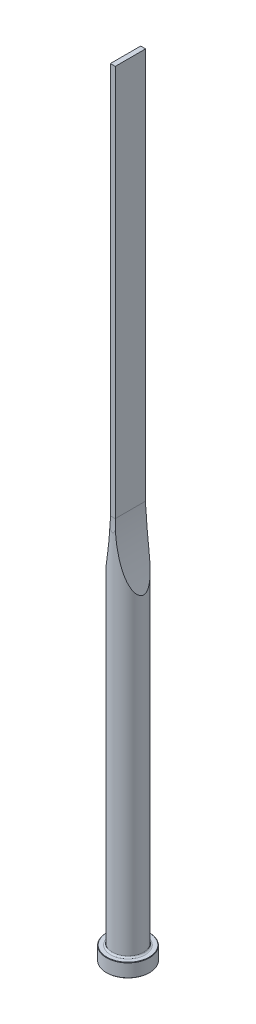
from build123d import *

# Parameters (mm, degrees)
CUT_EXTRUDE1_DEPTH = 10
CUT_EXTRUDE2_DEPTH = 10


with BuildPart() as part:
    # Sketch1 → Revolve1 (revolve)
    with BuildSketch(Plane.XY, mode=Mode.PRIVATE) as revolve1_sk:
        with BuildLine():
            Line((0, 0), (10.8, 0))
            Line((10.8, 0), (11, 0.2))
            Line((11, 0.2), (11, 6.8))
            Line((11, 6.8), (10.8, 7))
            Line((10.8, 7), (8.8, 7))
            ThreePointArc((8.8, 7), (8.234314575, 7.234314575), (8, 7.8))
            Line((8, 7.8), (8, 400))
            Line((8, 400), (0, 400))
            Line((0, 400), (0, 0))
        make_face()
    revolve(revolve1_sk.sketch.rotate(Axis((0, 400, 0), (0, -1, 0)), 180), axis=Axis((0, 400, 0), (0, -1, 0)))

    # Sketch2 → Cut-Extrude1 (cut, symmetric)
    with BuildSketch(Plane.XY):
        with BuildLine():
            Line((1.25, 400), (1.25, 200))
            ThreePointArc((1.25, 200), (2.953624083, 182.571574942), (8, 165.802960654))
            Line((8, 165.802960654), (8, 400))
            Line((8, 400), (1.25, 400))
        make_face()
        with BuildLine():
            Line((-1.25, 400), (-1.25, 200))
            ThreePointArc((-1.25, 200), (-2.953624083, 182.571574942), (-8, 165.802960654))
            Line((-8, 165.802960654), (-8, 400))
            Line((-8, 400), (-1.25, 400))
        make_face()
    extrude(amount=CUT_EXTRUDE1_DEPTH, both=True, mode=Mode.SUBTRACT)

    # Sketch3 → Cut-Extrude2 (cut, symmetric)
    with BuildSketch(Plane(origin=(0, 0, 0), x_dir=(0, 0, -1), z_dir=(1, 0, 0))):
        with BuildLine():
            Line((7.75, 400), (7.75, 200))
            ThreePointArc((7.75, 200), (7.812521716, 196.645898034), (8, 193.296456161))
            Line((8, 193.296456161), (8, 400))
            Line((8, 400), (7.75, 400))
        make_face()
        with BuildLine():
            Line((-7.75, 400), (-7.75, 200))
            ThreePointArc((-7.75, 200), (-7.812521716, 196.645898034), (-8, 193.296456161))
            Line((-8, 193.296456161), (-8, 400))
            Line((-8, 400), (-7.75, 400))
        make_face()
    extrude(amount=CUT_EXTRUDE2_DEPTH, both=True, mode=Mode.SUBTRACT)


solid = part.part
